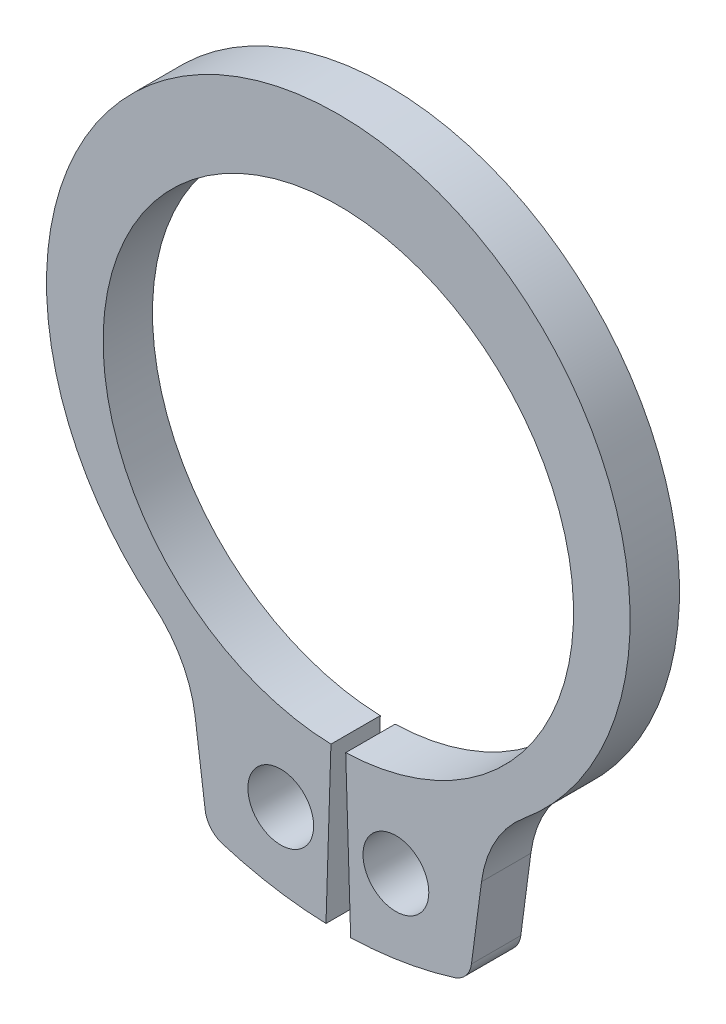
from build123d import *

# Parameters (mm, degrees)
BODYSKE_R  = 1
BODY_DEPTH = 1.5


with BuildPart() as part:
    # BodySke → Body (new body)
    with BuildSketch(Plane.XY):
        with BuildLine():
            Line((0.224372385, -7.146478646), (0.375, -11.94411466))
            ThreePointArc((0.375, -11.94411466), (1.967341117, -11.786944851), (3.524410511, -11.41845132))
            ThreePointArc((3.524410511, -11.41845132), (3.87628543, -11.185638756), (4.046796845, -10.79970676))
            Line((4.046796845, -10.79970676), (4.352083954, -8.480820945))
            ThreePointArc((4.352083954, -8.480820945), (4.773361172, -7.204601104), (5.633707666, -6.172120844))
            ThreePointArc((5.633707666, -6.172120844), (0, 9.55), (-5.633707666, -6.172120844))
            ThreePointArc((-5.633707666, -6.172120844), (-4.773361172, -7.204601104), (-4.352083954, -8.480820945))
            Line((-4.352083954, -8.480820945), (-4.046796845, -10.79970676))
            ThreePointArc((-4.046796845, -10.79970676), (-3.87628543, -11.185638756), (-3.524410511, -11.41845132))
            ThreePointArc((-3.524410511, -11.41845132), (-1.967341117, -11.786944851), (-0.375, -11.94411466))
            Line((-0.375, -11.94411466), (-0.224372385, -7.146478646))
            ThreePointArc((-0.224372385, -7.146478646), (0, 7.15), (0.224372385, -7.146478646))
        make_face()
        with Locations((1.75, -9.566249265)):
            Circle(BODYSKE_R, mode=Mode.SUBTRACT)
        with Locations((-1.75, -9.566249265)):
            Circle(BODYSKE_R, mode=Mode.SUBTRACT)
    extrude(amount=-BODY_DEPTH)


solid = part.part
